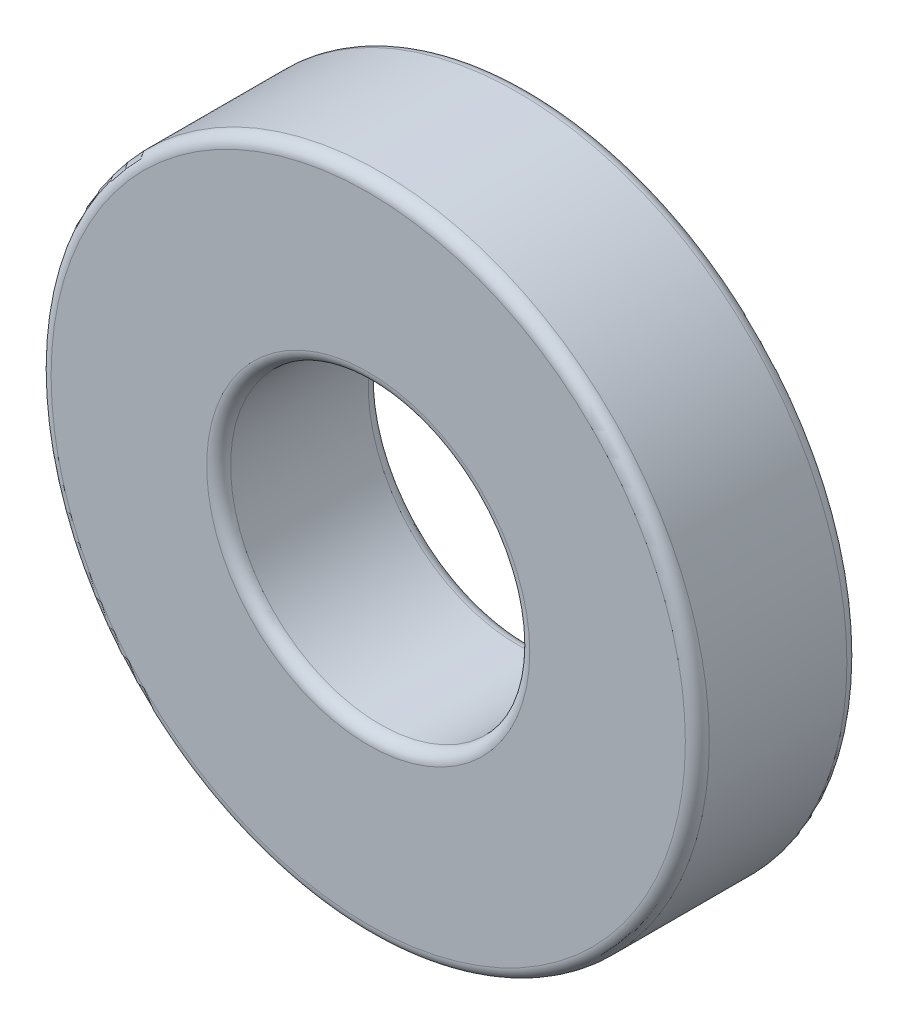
ISO-10303-21;
HEADER;
FILE_DESCRIPTION(('STEP AP214'),'2;1');
FILE_NAME('part.step','',(''),(''),'','','');
FILE_SCHEMA(('AUTOMOTIVE_DESIGN { 1 0 10303 214 1 1 1 1 }'));
ENDSEC;
DATA;
#1=APPLICATION_CONTEXT('core data for automotive mechanical design processes');
#2=APPLICATION_PROTOCOL_DEFINITION('international standard','automotive_design',2000,#1);
#3=PRODUCT_CONTEXT('',#1,'mechanical');
#4=PRODUCT('Part','Part','',(#3));
#5=PRODUCT_RELATED_PRODUCT_CATEGORY('part','',(#4));
#6=PRODUCT_DEFINITION_FORMATION('','',#4);
#7=PRODUCT_DEFINITION_CONTEXT('part definition',#1,'design');
#8=PRODUCT_DEFINITION('design','',#6,#7);
#9=PRODUCT_DEFINITION_SHAPE('','',#8);
#10=(LENGTH_UNIT() NAMED_UNIT(*) SI_UNIT(.MILLI.,.METRE.));
#11=(NAMED_UNIT(*) PLANE_ANGLE_UNIT() SI_UNIT($,.RADIAN.));
#12=(NAMED_UNIT(*) SI_UNIT($,.STERADIAN.) SOLID_ANGLE_UNIT());
#13=UNCERTAINTY_MEASURE_WITH_UNIT(LENGTH_MEASURE(1.E-05),#10,'distance_accuracy_value','');
#14=(GEOMETRIC_REPRESENTATION_CONTEXT(3) GLOBAL_UNCERTAINTY_ASSIGNED_CONTEXT((#13)) GLOBAL_UNIT_ASSIGNED_CONTEXT((#10,
#11,#12)) REPRESENTATION_CONTEXT('',''));
#15=CARTESIAN_POINT('',(0.,0.,0.));
#16=DIRECTION('',(0.,0.,1.));
#17=DIRECTION('',(1.,0.,0.));
#18=AXIS2_PLACEMENT_3D('',#15,#16,#17);
#19=CARTESIAN_POINT('',(0.,0.,-2.));
#20=DIRECTION('',(0.,0.,1.));
#21=DIRECTION('',(1.,0.,0.));
#22=AXIS2_PLACEMENT_3D('',#19,#20,#21);
#23=TOROIDAL_SURFACE('',#22,53.,2.);
#24=CARTESIAN_POINT('',(0.,0.,-2.));
#25=DIRECTION('',(0.,0.,1.));
#26=DIRECTION('',(1.,0.,0.));
#27=AXIS2_PLACEMENT_3D('',#24,#25,#26);
#28=CIRCLE('',#27,55.);
#29=CARTESIAN_POINT('',(55.,0.,-2.));
#30=VERTEX_POINT('',#29);
#31=EDGE_CURVE('E10',#30,#30,#28,.T.);
#32=ORIENTED_EDGE('',*,*,#31,.T.);
#33=EDGE_LOOP('',(#32));
#34=FACE_BOUND('',#33,.T.);
#35=CARTESIAN_POINT('',(0.,0.,0.));
#36=DIRECTION('',(0.,0.,1.));
#37=DIRECTION('',(1.,0.,0.));
#38=AXIS2_PLACEMENT_3D('',#35,#36,#37);
#39=CIRCLE('',#38,53.);
#40=CARTESIAN_POINT('',(53.,0.,0.));
#41=VERTEX_POINT('',#40);
#42=EDGE_CURVE('E470',#41,#41,#39,.T.);
#43=ORIENTED_EDGE('',*,*,#42,.F.);
#44=EDGE_LOOP('',(#43));
#45=FACE_BOUND('',#44,.T.);
#46=ADVANCED_FACE('F442',(#34,#45),#23,.T.);
#47=CARTESIAN_POINT('',(0.,0.,33.1757165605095));
#48=DIRECTION('',(0.,0.,1.));
#49=DIRECTION('',(1.,0.,0.));
#50=AXIS2_PLACEMENT_3D('',#47,#48,#49);
#51=CYLINDRICAL_SURFACE('',#50,55.);
#52=CARTESIAN_POINT('',(0.,0.,-25.));
#53=DIRECTION('',(0.,0.,1.));
#54=DIRECTION('',(1.,0.,0.));
#55=AXIS2_PLACEMENT_3D('',#52,#53,#54);
#56=CIRCLE('',#55,55.);
#57=CARTESIAN_POINT('',(55.,0.,-25.));
#58=VERTEX_POINT('',#57);
#59=EDGE_CURVE('E448',#58,#58,#56,.T.);
#60=ORIENTED_EDGE('',*,*,#59,.T.);
#61=EDGE_LOOP('',(#60));
#62=FACE_BOUND('',#61,.T.);
#63=ORIENTED_EDGE('',*,*,#31,.F.);
#64=EDGE_LOOP('',(#63));
#65=FACE_BOUND('',#64,.T.);
#66=ADVANCED_FACE('F572',(#62,#65),#51,.T.);
#67=CARTESIAN_POINT('',(0.,0.,-25.));
#68=DIRECTION('',(0.,0.,1.));
#69=DIRECTION('',(1.,0.,0.));
#70=AXIS2_PLACEMENT_3D('',#67,#68,#69);
#71=TOROIDAL_SURFACE('',#70,53.,2.);
#72=ORIENTED_EDGE('',*,*,#59,.F.);
#73=EDGE_LOOP('',(#72));
#74=FACE_BOUND('',#73,.T.);
#75=CARTESIAN_POINT('',(0.,0.,-27.));
#76=DIRECTION('',(0.,0.,1.));
#77=DIRECTION('',(1.,0.,0.));
#78=AXIS2_PLACEMENT_3D('',#75,#76,#77);
#79=CIRCLE('',#78,53.);
#80=CARTESIAN_POINT('',(53.,0.,-27.));
#81=VERTEX_POINT('',#80);
#82=EDGE_CURVE('E452',#81,#81,#79,.T.);
#83=ORIENTED_EDGE('',*,*,#82,.T.);
#84=EDGE_LOOP('',(#83));
#85=FACE_BOUND('',#84,.T.);
#86=ADVANCED_FACE('F569',(#74,#85),#71,.T.);
#87=CARTESIAN_POINT('',(0.,53.,-27.));
#88=DIRECTION('',(0.,0.,-1.));
#89=DIRECTION('',(-1.,0.,0.));
#90=AXIS2_PLACEMENT_3D('',#87,#88,#89);
#91=PLANE('',#90);
#92=CARTESIAN_POINT('',(0.,0.,-27.));
#93=DIRECTION('',(0.,0.,1.));
#94=DIRECTION('',(1.,0.,0.));
#95=AXIS2_PLACEMENT_3D('',#92,#93,#94);
#96=CIRCLE('',#95,27.);
#97=CARTESIAN_POINT('',(27.,0.,-27.));
#98=VERTEX_POINT('',#97);
#99=EDGE_CURVE('E456',#98,#98,#96,.T.);
#100=ORIENTED_EDGE('',*,*,#99,.T.);
#101=EDGE_LOOP('',(#100));
#102=FACE_BOUND('',#101,.T.);
#103=ORIENTED_EDGE('',*,*,#82,.F.);
#104=EDGE_LOOP('',(#103));
#105=FACE_BOUND('',#104,.T.);
#106=ADVANCED_FACE('F565',(#102,#105),#91,.T.);
#107=CARTESIAN_POINT('',(0.,0.,-25.));
#108=DIRECTION('',(0.,0.,1.));
#109=DIRECTION('',(1.,0.,0.));
#110=AXIS2_PLACEMENT_3D('',#107,#108,#109);
#111=TOROIDAL_SURFACE('',#110,27.,2.);
#112=CARTESIAN_POINT('',(0.,0.,-25.));
#113=DIRECTION('',(0.,0.,1.));
#114=DIRECTION('',(1.,0.,0.));
#115=AXIS2_PLACEMENT_3D('',#112,#113,#114);
#116=CIRCLE('',#115,25.);
#117=CARTESIAN_POINT('',(25.,0.,-25.));
#118=VERTEX_POINT('',#117);
#119=EDGE_CURVE('E461',#118,#118,#116,.T.);
#120=ORIENTED_EDGE('',*,*,#119,.T.);
#121=EDGE_LOOP('',(#120));
#122=FACE_BOUND('',#121,.T.);
#123=ORIENTED_EDGE('',*,*,#99,.F.);
#124=EDGE_LOOP('',(#123));
#125=FACE_BOUND('',#124,.T.);
#126=ADVANCED_FACE('F561',(#122,#125),#111,.T.);
#127=CARTESIAN_POINT('',(0.,0.,33.1757165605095));
#128=DIRECTION('',(0.,0.,1.));
#129=DIRECTION('',(1.,0.,0.));
#130=AXIS2_PLACEMENT_3D('',#127,#128,#129);
#131=CYLINDRICAL_SURFACE('',#130,25.);
#132=CARTESIAN_POINT('',(0.,0.,-2.));
#133=DIRECTION('',(0.,0.,1.));
#134=DIRECTION('',(1.,0.,0.));
#135=AXIS2_PLACEMENT_3D('',#132,#133,#134);
#136=CIRCLE('',#135,25.);
#137=CARTESIAN_POINT('',(25.,0.,-2.));
#138=VERTEX_POINT('',#137);
#139=EDGE_CURVE('E464',#138,#138,#136,.T.);
#140=ORIENTED_EDGE('',*,*,#139,.T.);
#141=EDGE_LOOP('',(#140));
#142=FACE_BOUND('',#141,.T.);
#143=ORIENTED_EDGE('',*,*,#119,.F.);
#144=EDGE_LOOP('',(#143));
#145=FACE_BOUND('',#144,.T.);
#146=ADVANCED_FACE('F557',(#142,#145),#131,.F.);
#147=CARTESIAN_POINT('',(0.,0.,-2.));
#148=DIRECTION('',(0.,0.,1.));
#149=DIRECTION('',(1.,0.,0.));
#150=AXIS2_PLACEMENT_3D('',#147,#148,#149);
#151=TOROIDAL_SURFACE('',#150,27.,2.);
#152=CARTESIAN_POINT('',(0.,0.,0.));
#153=DIRECTION('',(0.,0.,1.));
#154=DIRECTION('',(1.,0.,0.));
#155=AXIS2_PLACEMENT_3D('',#152,#153,#154);
#156=CIRCLE('',#155,27.);
#157=CARTESIAN_POINT('',(27.,0.,0.));
#158=VERTEX_POINT('',#157);
#159=EDGE_CURVE('E467',#158,#158,#156,.T.);
#160=ORIENTED_EDGE('',*,*,#159,.T.);
#161=EDGE_LOOP('',(#160));
#162=FACE_BOUND('',#161,.T.);
#163=ORIENTED_EDGE('',*,*,#139,.F.);
#164=EDGE_LOOP('',(#163));
#165=FACE_BOUND('',#164,.T.);
#166=ADVANCED_FACE('F553',(#162,#165),#151,.T.);
#167=CARTESIAN_POINT('',(0.,27.,0.));
#168=DIRECTION('',(0.,0.,1.));
#169=DIRECTION('',(1.,0.,0.));
#170=AXIS2_PLACEMENT_3D('',#167,#168,#169);
#171=PLANE('',#170);
#172=ORIENTED_EDGE('',*,*,#42,.T.);
#173=EDGE_LOOP('',(#172));
#174=FACE_BOUND('',#173,.T.);
#175=ORIENTED_EDGE('',*,*,#159,.F.);
#176=EDGE_LOOP('',(#175));
#177=FACE_BOUND('',#176,.T.);
#178=ADVANCED_FACE('F551',(#174,#177),#171,.T.);
#179=CLOSED_SHELL('',(#46,#66,#86,#106,#126,#146,#166,#178));
#180=CARTESIAN_POINT('',(0.,47.5,-13.485));
#181=DIRECTION('',(0.,0.,1.));
#182=DIRECTION('',(1.,0.,0.));
#183=AXIS2_PLACEMENT_3D('',#180,#181,#182);
#184=PLANE('',#183);
#185=CARTESIAN_POINT('',(0.,0.,-13.485));
#186=DIRECTION('',(0.,0.,1.));
#187=DIRECTION('',(1.,0.,0.));
#188=AXIS2_PLACEMENT_3D('',#185,#186,#187);
#189=CIRCLE('',#188,47.51);
#190=CARTESIAN_POINT('',(47.51,0.,-13.485));
#191=VERTEX_POINT('',#190);
#192=EDGE_CURVE('E473',#191,#191,#189,.T.);
#193=ORIENTED_EDGE('',*,*,#192,.F.);
#194=EDGE_LOOP('',(#193));
#195=FACE_BOUND('',#194,.T.);
#196=CARTESIAN_POINT('',(0.,0.,-13.485));
#197=DIRECTION('',(0.,0.,1.));
#198=DIRECTION('',(1.,0.,0.));
#199=AXIS2_PLACEMENT_3D('',#196,#197,#198);
#200=CIRCLE('',#199,40.015);
#201=CARTESIAN_POINT('',(40.015,0.,-13.485));
#202=VERTEX_POINT('',#201);
#203=EDGE_CURVE('E506',#202,#202,#200,.T.);
#204=ORIENTED_EDGE('',*,*,#203,.T.);
#205=EDGE_LOOP('',(#204));
#206=FACE_BOUND('',#205,.T.);
#207=ADVANCED_FACE('F510',(#195,#206),#184,.F.);
#208=CARTESIAN_POINT('',(0.,0.,8.31184503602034));
#209=DIRECTION('',(0.,0.,1.));
#210=DIRECTION('',(1.,0.,0.));
#211=AXIS2_PLACEMENT_3D('',#208,#209,#210);
#212=CYLINDRICAL_SURFACE('',#211,47.51);
#213=CARTESIAN_POINT('',(0.,0.,-13.515));
#214=DIRECTION('',(0.,0.,1.));
#215=DIRECTION('',(1.,0.,0.));
#216=AXIS2_PLACEMENT_3D('',#213,#214,#215);
#217=CIRCLE('',#216,47.51);
#218=CARTESIAN_POINT('',(47.51,0.,-13.515));
#219=VERTEX_POINT('',#218);
#220=EDGE_CURVE('E476',#219,#219,#217,.T.);
#221=ORIENTED_EDGE('',*,*,#220,.F.);
#222=EDGE_LOOP('',(#221));
#223=FACE_BOUND('',#222,.T.);
#224=ORIENTED_EDGE('',*,*,#192,.T.);
#225=EDGE_LOOP('',(#224));
#226=FACE_BOUND('',#225,.T.);
#227=ADVANCED_FACE('F538',(#223,#226),#212,.F.);
#228=CARTESIAN_POINT('',(0.,47.5,-13.515));
#229=DIRECTION('',(0.,0.,1.));
#230=DIRECTION('',(1.,0.,0.));
#231=AXIS2_PLACEMENT_3D('',#228,#229,#230);
#232=PLANE('',#231);
#233=ORIENTED_EDGE('',*,*,#220,.T.);
#234=EDGE_LOOP('',(#233));
#235=FACE_BOUND('',#234,.T.);
#236=CARTESIAN_POINT('',(0.,0.,-13.515));
#237=DIRECTION('',(0.,0.,1.));
#238=DIRECTION('',(1.,0.,0.));
#239=AXIS2_PLACEMENT_3D('',#236,#237,#238);
#240=CIRCLE('',#239,40.015);
#241=CARTESIAN_POINT('',(40.015,0.,-13.515));
#242=VERTEX_POINT('',#241);
#243=EDGE_CURVE('E479',#242,#242,#240,.T.);
#244=ORIENTED_EDGE('',*,*,#243,.F.);
#245=EDGE_LOOP('',(#244));
#246=FACE_BOUND('',#245,.T.);
#247=ADVANCED_FACE('F545',(#235,#246),#232,.T.);
#248=CARTESIAN_POINT('',(0.,0.,8.31184503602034));
#249=DIRECTION('',(0.,0.,1.));
#250=DIRECTION('',(1.,0.,0.));
#251=AXIS2_PLACEMENT_3D('',#248,#249,#250);
#252=CYLINDRICAL_SURFACE('',#251,40.015);
#253=ORIENTED_EDGE('',*,*,#243,.T.);
#254=EDGE_LOOP('',(#253));
#255=FACE_BOUND('',#254,.T.);
#256=CARTESIAN_POINT('',(0.,0.,-24.31));
#257=DIRECTION('',(0.,0.,1.));
#258=DIRECTION('',(1.,0.,0.));
#259=AXIS2_PLACEMENT_3D('',#256,#257,#258);
#260=CIRCLE('',#259,40.015);
#261=CARTESIAN_POINT('',(40.015,0.,-24.31));
#262=VERTEX_POINT('',#261);
#263=EDGE_CURVE('E482',#262,#262,#260,.T.);
#264=ORIENTED_EDGE('',*,*,#263,.F.);
#265=EDGE_LOOP('',(#264));
#266=FACE_BOUND('',#265,.T.);
#267=ADVANCED_FACE('F633',(#255,#266),#252,.F.);
#268=CARTESIAN_POINT('',(0.,47.5,-24.31));
#269=DIRECTION('',(0.,0.,1.));
#270=DIRECTION('',(1.,0.,0.));
#271=AXIS2_PLACEMENT_3D('',#268,#269,#270);
#272=PLANE('',#271);
#273=ORIENTED_EDGE('',*,*,#263,.T.);
#274=EDGE_LOOP('',(#273));
#275=FACE_BOUND('',#274,.T.);
#276=CARTESIAN_POINT('',(0.,0.,-24.31));
#277=DIRECTION('',(0.,0.,1.));
#278=DIRECTION('',(1.,0.,0.));
#279=AXIS2_PLACEMENT_3D('',#276,#277,#278);
#280=CIRCLE('',#279,39.985);
#281=CARTESIAN_POINT('',(39.985,0.,-24.31));
#282=VERTEX_POINT('',#281);
#283=EDGE_CURVE('E485',#282,#282,#280,.T.);
#284=ORIENTED_EDGE('',*,*,#283,.F.);
#285=EDGE_LOOP('',(#284));
#286=FACE_BOUND('',#285,.T.);
#287=ADVANCED_FACE('F640',(#275,#286),#272,.T.);
#288=CARTESIAN_POINT('',(0.,0.,8.31184503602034));
#289=DIRECTION('',(0.,0.,1.));
#290=DIRECTION('',(1.,0.,0.));
#291=AXIS2_PLACEMENT_3D('',#288,#289,#290);
#292=CYLINDRICAL_SURFACE('',#291,39.985);
#293=CARTESIAN_POINT('',(0.,0.,-13.515));
#294=DIRECTION('',(0.,0.,1.));
#295=DIRECTION('',(1.,0.,0.));
#296=AXIS2_PLACEMENT_3D('',#293,#294,#295);
#297=CIRCLE('',#296,39.985);
#298=CARTESIAN_POINT('',(39.985,0.,-13.515));
#299=VERTEX_POINT('',#298);
#300=EDGE_CURVE('E488',#299,#299,#297,.T.);
#301=ORIENTED_EDGE('',*,*,#300,.F.);
#302=EDGE_LOOP('',(#301));
#303=FACE_BOUND('',#302,.T.);
#304=ORIENTED_EDGE('',*,*,#283,.T.);
#305=EDGE_LOOP('',(#304));
#306=FACE_BOUND('',#305,.T.);
#307=ADVANCED_FACE('F648',(#303,#306),#292,.T.);
#308=CARTESIAN_POINT('',(0.,47.5,-13.515));
#309=DIRECTION('',(0.,0.,-1.));
#310=DIRECTION('',(-1.,0.,0.));
#311=AXIS2_PLACEMENT_3D('',#308,#309,#310);
#312=PLANE('',#311);
#313=CARTESIAN_POINT('',(0.,0.,-13.515));
#314=DIRECTION('',(0.,0.,1.));
#315=DIRECTION('',(1.,0.,0.));
#316=AXIS2_PLACEMENT_3D('',#313,#314,#315);
#317=CIRCLE('',#316,32.49);
#318=CARTESIAN_POINT('',(32.49,0.,-13.515));
#319=VERTEX_POINT('',#318);
#320=EDGE_CURVE('E491',#319,#319,#317,.T.);
#321=ORIENTED_EDGE('',*,*,#320,.F.);
#322=EDGE_LOOP('',(#321));
#323=FACE_BOUND('',#322,.T.);
#324=ORIENTED_EDGE('',*,*,#300,.T.);
#325=EDGE_LOOP('',(#324));
#326=FACE_BOUND('',#325,.T.);
#327=ADVANCED_FACE('F656',(#323,#326),#312,.F.);
#328=CARTESIAN_POINT('',(0.,0.,8.31184503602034));
#329=DIRECTION('',(0.,0.,1.));
#330=DIRECTION('',(1.,0.,0.));
#331=AXIS2_PLACEMENT_3D('',#328,#329,#330);
#332=CYLINDRICAL_SURFACE('',#331,32.49);
#333=ORIENTED_EDGE('',*,*,#320,.T.);
#334=EDGE_LOOP('',(#333));
#335=FACE_BOUND('',#334,.T.);
#336=CARTESIAN_POINT('',(0.,0.,-13.485));
#337=DIRECTION('',(0.,0.,1.));
#338=DIRECTION('',(1.,0.,0.));
#339=AXIS2_PLACEMENT_3D('',#336,#337,#338);
#340=CIRCLE('',#339,32.49);
#341=CARTESIAN_POINT('',(32.49,0.,-13.485));
#342=VERTEX_POINT('',#341);
#343=EDGE_CURVE('E494',#342,#342,#340,.T.);
#344=ORIENTED_EDGE('',*,*,#343,.F.);
#345=EDGE_LOOP('',(#344));
#346=FACE_BOUND('',#345,.T.);
#347=ADVANCED_FACE('F533',(#335,#346),#332,.T.);
#348=CARTESIAN_POINT('',(0.,47.5,-13.485));
#349=DIRECTION('',(0.,0.,-1.));
#350=DIRECTION('',(-1.,0.,0.));
#351=AXIS2_PLACEMENT_3D('',#348,#349,#350);
#352=PLANE('',#351);
#353=ORIENTED_EDGE('',*,*,#343,.T.);
#354=EDGE_LOOP('',(#353));
#355=FACE_BOUND('',#354,.T.);
#356=CARTESIAN_POINT('',(0.,0.,-13.485));
#357=DIRECTION('',(0.,0.,1.));
#358=DIRECTION('',(1.,0.,0.));
#359=AXIS2_PLACEMENT_3D('',#356,#357,#358);
#360=CIRCLE('',#359,39.985);
#361=CARTESIAN_POINT('',(39.985,0.,-13.485));
#362=VERTEX_POINT('',#361);
#363=EDGE_CURVE('E497',#362,#362,#360,.T.);
#364=ORIENTED_EDGE('',*,*,#363,.F.);
#365=EDGE_LOOP('',(#364));
#366=FACE_BOUND('',#365,.T.);
#367=ADVANCED_FACE('F527',(#355,#366),#352,.T.);
#368=CARTESIAN_POINT('',(0.,0.,8.31184503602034));
#369=DIRECTION('',(0.,0.,1.));
#370=DIRECTION('',(1.,0.,0.));
#371=AXIS2_PLACEMENT_3D('',#368,#369,#370);
#372=CYLINDRICAL_SURFACE('',#371,39.985);
#373=ORIENTED_EDGE('',*,*,#363,.T.);
#374=EDGE_LOOP('',(#373));
#375=FACE_BOUND('',#374,.T.);
#376=CARTESIAN_POINT('',(0.,0.,-2.68999999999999));
#377=DIRECTION('',(0.,0.,1.));
#378=DIRECTION('',(1.,0.,0.));
#379=AXIS2_PLACEMENT_3D('',#376,#377,#378);
#380=CIRCLE('',#379,39.985);
#381=CARTESIAN_POINT('',(39.985,0.,-2.68999999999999));
#382=VERTEX_POINT('',#381);
#383=EDGE_CURVE('E500',#382,#382,#380,.T.);
#384=ORIENTED_EDGE('',*,*,#383,.F.);
#385=EDGE_LOOP('',(#384));
#386=FACE_BOUND('',#385,.T.);
#387=ADVANCED_FACE('F522',(#375,#386),#372,.T.);
#388=CARTESIAN_POINT('',(0.,47.5,-2.68999999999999));
#389=DIRECTION('',(0.,0.,1.));
#390=DIRECTION('',(1.,0.,0.));
#391=AXIS2_PLACEMENT_3D('',#388,#389,#390);
#392=PLANE('',#391);
#393=CARTESIAN_POINT('',(0.,0.,-2.68999999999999));
#394=DIRECTION('',(0.,0.,1.));
#395=DIRECTION('',(1.,0.,0.));
#396=AXIS2_PLACEMENT_3D('',#393,#394,#395);
#397=CIRCLE('',#396,40.015);
#398=CARTESIAN_POINT('',(40.015,0.,-2.68999999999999));
#399=VERTEX_POINT('',#398);
#400=EDGE_CURVE('E503',#399,#399,#397,.T.);
#401=ORIENTED_EDGE('',*,*,#400,.F.);
#402=EDGE_LOOP('',(#401));
#403=FACE_BOUND('',#402,.T.);
#404=ORIENTED_EDGE('',*,*,#383,.T.);
#405=EDGE_LOOP('',(#404));
#406=FACE_BOUND('',#405,.T.);
#407=ADVANCED_FACE('F515',(#403,#406),#392,.F.);
#408=CARTESIAN_POINT('',(0.,0.,8.31184503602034));
#409=DIRECTION('',(0.,0.,1.));
#410=DIRECTION('',(1.,0.,0.));
#411=AXIS2_PLACEMENT_3D('',#408,#409,#410);
#412=CYLINDRICAL_SURFACE('',#411,40.015);
#413=ORIENTED_EDGE('',*,*,#203,.F.);
#414=EDGE_LOOP('',(#413));
#415=FACE_BOUND('',#414,.T.);
#416=ORIENTED_EDGE('',*,*,#400,.T.);
#417=EDGE_LOOP('',(#416));
#418=FACE_BOUND('',#417,.T.);
#419=ADVANCED_FACE('F512',(#415,#418),#412,.F.);
#420=CLOSED_SHELL('',(#207,#227,#247,#267,#287,#307,#327,#347,#367,#387,#407,#419));
#421=ORIENTED_CLOSED_SHELL('',*,#420,.T.);
#422=BREP_WITH_VOIDS('B2',#179,(#421));
#423=ADVANCED_BREP_SHAPE_REPRESENTATION('',(#18,#422),#14);
#424=SHAPE_DEFINITION_REPRESENTATION(#9,#423);
ENDSEC;
END-ISO-10303-21;
